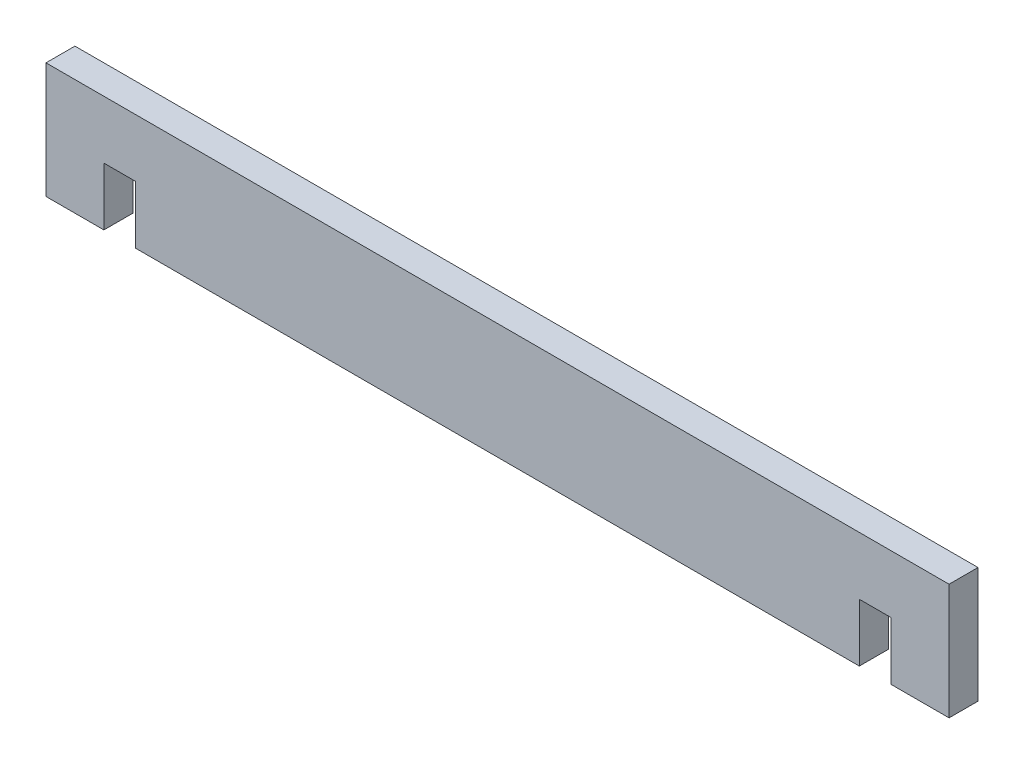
from build123d import *

# Parameters (mm, degrees)
ESQUISSE1_W                         = 624
ESQUISSE1_H                         = 80
BOSS_EXTRU_1_DEPTH                  = 10
ENL_V_MAT_EXTRU_1_REACH             = 631.187
ESQUISSE3_W                         = 22
ESQUISSE3_H                         = 40
ENL_V_MAT_EXTRU_1_DIRECTION_2_REACH = 631.187


with BuildPart() as part:
    # Esquisse1 → Boss.-Extru.1 (new, symmetric)
    with BuildSketch(Plane.XY):
        with Locations((312, 40)):
            Rectangle(ESQUISSE1_W, ESQUISSE1_H)
    extrude(amount=BOSS_EXTRU_1_DEPTH, both=True)

    # Esquisse3 → Enl_v. mat.-Extru.1 (cut, up to next)
    with BuildSketch(Plane.XY, mode=Mode.PRIVATE) as enl_v_mat_extru_1_sk1:
        with Locations((51, 20)):
            Rectangle(ESQUISSE3_W, ESQUISSE3_H)
    enl_v_mat_extru_1_tool1 = extrude(enl_v_mat_extru_1_sk1.sketch, amount=-ENL_V_MAT_EXTRU_1_REACH, mode=Mode.PRIVATE) & part.part
    # Esquisse3 → Enl_v. mat.-Extru.1 (cut, up to next)
    with BuildSketch(Plane.XY, mode=Mode.PRIVATE) as enl_v_mat_extru_1_sk2:
        with Locations((573, 20)):
            Rectangle(ESQUISSE3_W, ESQUISSE3_H)
    enl_v_mat_extru_1_tool2 = extrude(enl_v_mat_extru_1_sk2.sketch, amount=-ENL_V_MAT_EXTRU_1_REACH, mode=Mode.PRIVATE) & part.part
    add(enl_v_mat_extru_1_tool1.solids().sort_by_distance((51, 20, 0))[0], mode=Mode.SUBTRACT)
    add(enl_v_mat_extru_1_tool2.solids().sort_by_distance((573, 20, 0))[0], mode=Mode.SUBTRACT)

    # Esquisse3 → Enl_v. mat.-Extru.1 direction 2 (cut, up to next)
    with BuildSketch(Plane.XY, mode=Mode.PRIVATE) as enl_v_mat_extru_1_direction_2_sk1:
        with Locations((51, 20)):
            Rectangle(ESQUISSE3_W, ESQUISSE3_H)
    enl_v_mat_extru_1_direction_2_tool1 = extrude(enl_v_mat_extru_1_direction_2_sk1.sketch, amount=ENL_V_MAT_EXTRU_1_DIRECTION_2_REACH, mode=Mode.PRIVATE) & part.part
    # Esquisse3 → Enl_v. mat.-Extru.1 direction 2 (cut, up to next)
    with BuildSketch(Plane.XY, mode=Mode.PRIVATE) as enl_v_mat_extru_1_direction_2_sk2:
        with Locations((573, 20)):
            Rectangle(ESQUISSE3_W, ESQUISSE3_H)
    enl_v_mat_extru_1_direction_2_tool2 = extrude(enl_v_mat_extru_1_direction_2_sk2.sketch, amount=ENL_V_MAT_EXTRU_1_DIRECTION_2_REACH, mode=Mode.PRIVATE) & part.part
    add(enl_v_mat_extru_1_direction_2_tool1.solids().sort_by_distance((51, 20, 0))[0], mode=Mode.SUBTRACT)
    add(enl_v_mat_extru_1_direction_2_tool2.solids().sort_by_distance((573, 20, 0))[0], mode=Mode.SUBTRACT)


solid = part.part
